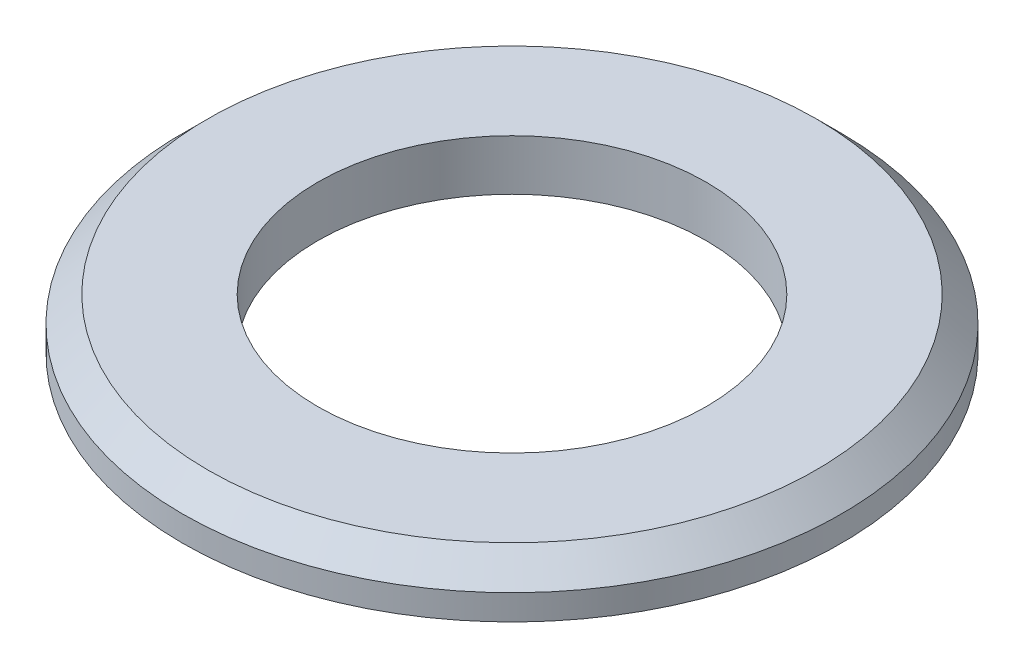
from build123d import *

# Parameters (mm, degrees)
SKETCH1_R      = 19.5
SKETCH1_R_2    = 11.5
EXTRUDE1_DEPTH = 3
CHAMFER1_SIZE  = 1.5


with BuildPart() as part:
    # Sketch1 → Extrude1 (new body)
    with BuildSketch(Plane(origin=(0, 0, 0), x_dir=(1, 0, 0), z_dir=(0, 1, 0))):
        with Locations(Location((0, 0, 0), (0, 0, 270))):
            Circle(SKETCH1_R)
        with Locations(Location((0, 0, 0), (0, 0, 270))):
            Circle(SKETCH1_R_2, mode=Mode.SUBTRACT)
    extrude(amount=EXTRUDE1_DEPTH)

    # Chamfer1
    chamfer1_edges = [part.edges().sort_by_distance(p)[0] for p in [
        (0, 3, -19.5),
    ]]
    chamfer(chamfer1_edges, length=CHAMFER1_SIZE)


solid = part.part
